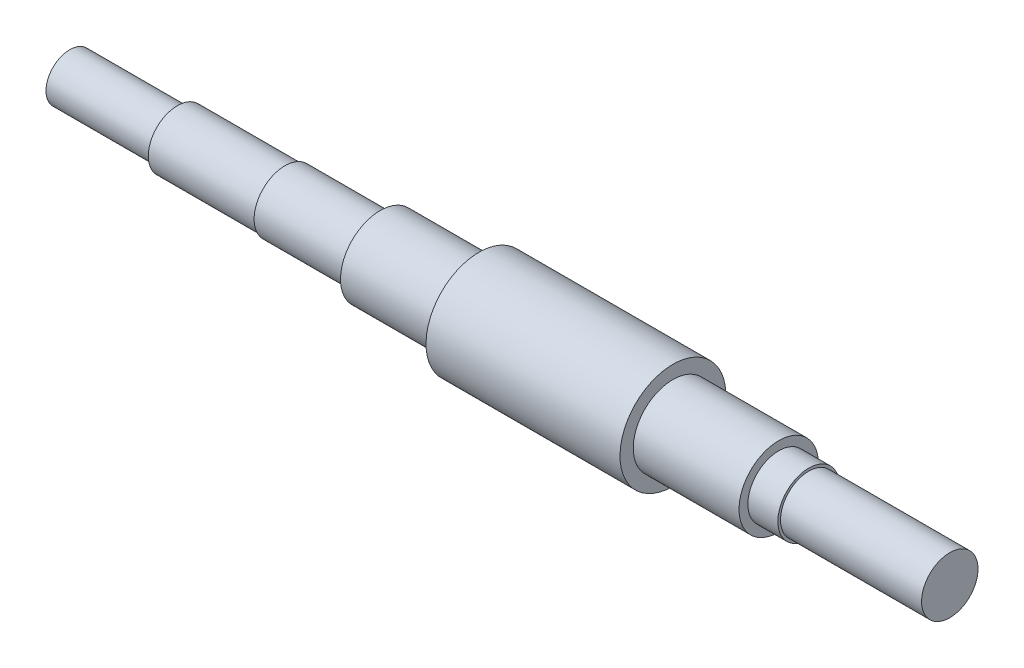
ISO-10303-21;
HEADER;
FILE_DESCRIPTION(('STEP AP214'),'2;1');
FILE_NAME('part.step','',(''),(''),'','','');
FILE_SCHEMA(('AUTOMOTIVE_DESIGN { 1 0 10303 214 1 1 1 1 }'));
ENDSEC;
DATA;
#1=APPLICATION_CONTEXT('core data for automotive mechanical design processes');
#2=APPLICATION_PROTOCOL_DEFINITION('international standard','automotive_design',2000,#1);
#3=PRODUCT_CONTEXT('',#1,'mechanical');
#4=PRODUCT('Part','Part','',(#3));
#5=PRODUCT_RELATED_PRODUCT_CATEGORY('part','',(#4));
#6=PRODUCT_DEFINITION_FORMATION('','',#4);
#7=PRODUCT_DEFINITION_CONTEXT('part definition',#1,'design');
#8=PRODUCT_DEFINITION('design','',#6,#7);
#9=PRODUCT_DEFINITION_SHAPE('','',#8);
#10=(LENGTH_UNIT() NAMED_UNIT(*) SI_UNIT(.MILLI.,.METRE.));
#11=(NAMED_UNIT(*) PLANE_ANGLE_UNIT() SI_UNIT($,.RADIAN.));
#12=(NAMED_UNIT(*) SI_UNIT($,.STERADIAN.) SOLID_ANGLE_UNIT());
#13=UNCERTAINTY_MEASURE_WITH_UNIT(LENGTH_MEASURE(1.E-05),#10,'distance_accuracy_value','');
#14=(GEOMETRIC_REPRESENTATION_CONTEXT(3) GLOBAL_UNCERTAINTY_ASSIGNED_CONTEXT((#13)) GLOBAL_UNIT_ASSIGNED_CONTEXT((#10,
#11,#12)) REPRESENTATION_CONTEXT('',''));
#15=CARTESIAN_POINT('',(0.,0.,0.));
#16=DIRECTION('',(0.,0.,1.));
#17=DIRECTION('',(1.,0.,0.));
#18=AXIS2_PLACEMENT_3D('',#15,#16,#17);
#19=CARTESIAN_POINT('',(0.,0.,0.));
#20=DIRECTION('',(-1.,0.,0.));
#21=DIRECTION('',(0.,-1.,0.));
#22=AXIS2_PLACEMENT_3D('',#19,#20,#21);
#23=PLANE('',#22);
#24=CARTESIAN_POINT('',(0.,0.,0.));
#25=DIRECTION('',(-1.,0.,0.));
#26=DIRECTION('',(0.,-1.,0.));
#27=AXIS2_PLACEMENT_3D('',#24,#25,#26);
#28=CIRCLE('',#27,13.5);
#29=CARTESIAN_POINT('',(0.,-13.5,0.));
#30=VERTEX_POINT('',#29);
#31=EDGE_CURVE('E18',#30,#30,#28,.F.);
#32=ORIENTED_EDGE('',*,*,#31,.F.);
#33=EDGE_LOOP('',(#32));
#34=FACE_BOUND('',#33,.T.);
#35=ADVANCED_FACE('F15',(#34),#23,.T.);
#36=CARTESIAN_POINT('',(523.95,0.,0.));
#37=DIRECTION('',(-1.,0.,0.));
#38=DIRECTION('',(0.,-1.,0.));
#39=AXIS2_PLACEMENT_3D('',#36,#37,#38);
#40=CYLINDRICAL_SURFACE('',#39,13.5);
#41=ORIENTED_EDGE('',*,*,#31,.T.);
#42=EDGE_LOOP('',(#41));
#43=FACE_BOUND('',#42,.T.);
#44=CARTESIAN_POINT('',(61.,0.,0.));
#45=DIRECTION('',(-1.,0.,0.));
#46=DIRECTION('',(0.,-1.,0.));
#47=AXIS2_PLACEMENT_3D('',#44,#45,#46);
#48=CIRCLE('',#47,13.5);
#49=CARTESIAN_POINT('',(61.,-13.5,0.));
#50=VERTEX_POINT('',#49);
#51=EDGE_CURVE('E64',#50,#50,#48,.F.);
#52=ORIENTED_EDGE('',*,*,#51,.F.);
#53=EDGE_LOOP('',(#52));
#54=FACE_BOUND('',#53,.T.);
#55=ADVANCED_FACE('F71',(#43,#54),#40,.T.);
#56=CARTESIAN_POINT('',(499.,0.,0.));
#57=DIRECTION('',(-1.,0.,0.));
#58=DIRECTION('',(0.,-1.,0.));
#59=AXIS2_PLACEMENT_3D('',#56,#57,#58);
#60=PLANE('',#59);
#61=CARTESIAN_POINT('',(499.,0.,0.));
#62=DIRECTION('',(-1.,0.,0.));
#63=DIRECTION('',(0.,-1.,0.));
#64=AXIS2_PLACEMENT_3D('',#61,#62,#63);
#65=CIRCLE('',#64,16.0000000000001);
#66=CARTESIAN_POINT('',(499.,-16.0000000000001,0.));
#67=VERTEX_POINT('',#66);
#68=EDGE_CURVE('E62',#67,#67,#65,.T.);
#69=ORIENTED_EDGE('',*,*,#68,.F.);
#70=EDGE_LOOP('',(#69));
#71=FACE_BOUND('',#70,.T.);
#72=ADVANCED_FACE('F79',(#71),#60,.F.);
#73=CARTESIAN_POINT('',(61.,0.,0.));
#74=DIRECTION('',(-1.,0.,0.));
#75=DIRECTION('',(0.,-1.,0.));
#76=AXIS2_PLACEMENT_3D('',#73,#74,#75);
#77=PLANE('',#76);
#78=ORIENTED_EDGE('',*,*,#51,.T.);
#79=EDGE_LOOP('',(#78));
#80=FACE_BOUND('',#79,.T.);
#81=CARTESIAN_POINT('',(61.,0.,0.));
#82=DIRECTION('',(-1.,0.,0.));
#83=DIRECTION('',(0.,-1.,0.));
#84=AXIS2_PLACEMENT_3D('',#81,#82,#83);
#85=CIRCLE('',#84,16.5);
#86=CARTESIAN_POINT('',(61.,-16.5,0.));
#87=VERTEX_POINT('',#86);
#88=EDGE_CURVE('E59',#87,#87,#85,.F.);
#89=ORIENTED_EDGE('',*,*,#88,.F.);
#90=EDGE_LOOP('',(#89));
#91=FACE_BOUND('',#90,.T.);
#92=ADVANCED_FACE('F134',(#80,#91),#77,.T.);
#93=CARTESIAN_POINT('',(523.95,0.,0.));
#94=DIRECTION('',(-1.,0.,0.));
#95=DIRECTION('',(0.,-1.,0.));
#96=AXIS2_PLACEMENT_3D('',#93,#94,#95);
#97=CYLINDRICAL_SURFACE('',#96,16.0000000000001);
#98=CARTESIAN_POINT('',(419.,0.,0.));
#99=DIRECTION('',(-1.,0.,0.));
#100=DIRECTION('',(0.,-1.,0.));
#101=AXIS2_PLACEMENT_3D('',#98,#99,#100);
#102=CIRCLE('',#101,16.0000000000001);
#103=CARTESIAN_POINT('',(419.,-16.0000000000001,0.));
#104=VERTEX_POINT('',#103);
#105=EDGE_CURVE('E56',#104,#104,#102,.F.);
#106=ORIENTED_EDGE('',*,*,#105,.T.);
#107=EDGE_LOOP('',(#106));
#108=FACE_BOUND('',#107,.T.);
#109=ORIENTED_EDGE('',*,*,#68,.T.);
#110=EDGE_LOOP('',(#109));
#111=FACE_BOUND('',#110,.T.);
#112=ADVANCED_FACE('F130',(#108,#111),#97,.T.);
#113=CARTESIAN_POINT('',(523.95,0.,0.));
#114=DIRECTION('',(-1.,0.,0.));
#115=DIRECTION('',(0.,-1.,0.));
#116=AXIS2_PLACEMENT_3D('',#113,#114,#115);
#117=CYLINDRICAL_SURFACE('',#116,16.5);
#118=ORIENTED_EDGE('',*,*,#88,.T.);
#119=EDGE_LOOP('',(#118));
#120=FACE_BOUND('',#119,.T.);
#121=CARTESIAN_POINT('',(122.,0.,0.));
#122=DIRECTION('',(-1.,0.,0.));
#123=DIRECTION('',(0.,-1.,0.));
#124=AXIS2_PLACEMENT_3D('',#121,#122,#123);
#125=CIRCLE('',#124,16.5);
#126=CARTESIAN_POINT('',(122.,-16.5,0.));
#127=VERTEX_POINT('',#126);
#128=EDGE_CURVE('E53',#127,#127,#125,.F.);
#129=ORIENTED_EDGE('',*,*,#128,.F.);
#130=EDGE_LOOP('',(#129));
#131=FACE_BOUND('',#130,.T.);
#132=ADVANCED_FACE('F126',(#120,#131),#117,.T.);
#133=CARTESIAN_POINT('',(419.,0.,0.));
#134=DIRECTION('',(-1.,0.,0.));
#135=DIRECTION('',(0.,-1.,0.));
#136=AXIS2_PLACEMENT_3D('',#133,#134,#135);
#137=PLANE('',#136);
#138=ORIENTED_EDGE('',*,*,#105,.F.);
#139=EDGE_LOOP('',(#138));
#140=FACE_BOUND('',#139,.T.);
#141=CARTESIAN_POINT('',(419.,0.,0.));
#142=DIRECTION('',(-1.,0.,0.));
#143=DIRECTION('',(0.,-1.,0.));
#144=AXIS2_PLACEMENT_3D('',#141,#142,#143);
#145=CIRCLE('',#144,17.5);
#146=CARTESIAN_POINT('',(419.,-17.5000000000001,0.));
#147=VERTEX_POINT('',#146);
#148=EDGE_CURVE('E50',#147,#147,#145,.T.);
#149=ORIENTED_EDGE('',*,*,#148,.F.);
#150=EDGE_LOOP('',(#149));
#151=FACE_BOUND('',#150,.T.);
#152=ADVANCED_FACE('F122',(#140,#151),#137,.F.);
#153=CARTESIAN_POINT('',(122.,0.,0.));
#154=DIRECTION('',(-1.,0.,0.));
#155=DIRECTION('',(0.,-1.,0.));
#156=AXIS2_PLACEMENT_3D('',#153,#154,#155);
#157=PLANE('',#156);
#158=ORIENTED_EDGE('',*,*,#128,.T.);
#159=EDGE_LOOP('',(#158));
#160=FACE_BOUND('',#159,.T.);
#161=CARTESIAN_POINT('',(122.,0.,0.));
#162=DIRECTION('',(-1.,0.,0.));
#163=DIRECTION('',(0.,-1.,0.));
#164=AXIS2_PLACEMENT_3D('',#161,#162,#163);
#165=CIRCLE('',#164,17.5);
#166=CARTESIAN_POINT('',(122.,-17.5,0.));
#167=VERTEX_POINT('',#166);
#168=EDGE_CURVE('E47',#167,#167,#165,.F.);
#169=ORIENTED_EDGE('',*,*,#168,.F.);
#170=EDGE_LOOP('',(#169));
#171=FACE_BOUND('',#170,.T.);
#172=ADVANCED_FACE('F118',(#160,#171),#157,.T.);
#173=CARTESIAN_POINT('',(523.95,0.,0.));
#174=DIRECTION('',(-1.,0.,0.));
#175=DIRECTION('',(0.,-1.,0.));
#176=AXIS2_PLACEMENT_3D('',#173,#174,#175);
#177=CYLINDRICAL_SURFACE('',#176,17.5);
#178=CARTESIAN_POINT('',(402.,0.,0.));
#179=DIRECTION('',(-1.,0.,0.));
#180=DIRECTION('',(0.,-1.,0.));
#181=AXIS2_PLACEMENT_3D('',#178,#179,#180);
#182=CIRCLE('',#181,17.5);
#183=CARTESIAN_POINT('',(402.,-17.5,0.));
#184=VERTEX_POINT('',#183);
#185=EDGE_CURVE('E44',#184,#184,#182,.F.);
#186=ORIENTED_EDGE('',*,*,#185,.T.);
#187=EDGE_LOOP('',(#186));
#188=FACE_BOUND('',#187,.T.);
#189=ORIENTED_EDGE('',*,*,#148,.T.);
#190=EDGE_LOOP('',(#189));
#191=FACE_BOUND('',#190,.T.);
#192=ADVANCED_FACE('F114',(#188,#191),#177,.T.);
#193=CARTESIAN_POINT('',(523.95,0.,0.));
#194=DIRECTION('',(-1.,0.,0.));
#195=DIRECTION('',(0.,-1.,0.));
#196=AXIS2_PLACEMENT_3D('',#193,#194,#195);
#197=CYLINDRICAL_SURFACE('',#196,17.5);
#198=ORIENTED_EDGE('',*,*,#168,.T.);
#199=EDGE_LOOP('',(#198));
#200=FACE_BOUND('',#199,.T.);
#201=CARTESIAN_POINT('',(176.,0.,0.));
#202=DIRECTION('',(-1.,0.,0.));
#203=DIRECTION('',(0.,-1.,0.));
#204=AXIS2_PLACEMENT_3D('',#201,#202,#203);
#205=CIRCLE('',#204,17.5);
#206=CARTESIAN_POINT('',(176.,-17.5,0.));
#207=VERTEX_POINT('',#206);
#208=EDGE_CURVE('E41',#207,#207,#205,.F.);
#209=ORIENTED_EDGE('',*,*,#208,.F.);
#210=EDGE_LOOP('',(#209));
#211=FACE_BOUND('',#210,.T.);
#212=ADVANCED_FACE('F110',(#200,#211),#197,.T.);
#213=CARTESIAN_POINT('',(402.,0.,0.));
#214=DIRECTION('',(-1.,0.,0.));
#215=DIRECTION('',(0.,-1.,0.));
#216=AXIS2_PLACEMENT_3D('',#213,#214,#215);
#217=PLANE('',#216);
#218=ORIENTED_EDGE('',*,*,#185,.F.);
#219=EDGE_LOOP('',(#218));
#220=FACE_BOUND('',#219,.T.);
#221=CARTESIAN_POINT('',(402.,0.,0.));
#222=DIRECTION('',(-1.,0.,0.));
#223=DIRECTION('',(0.,-1.,0.));
#224=AXIS2_PLACEMENT_3D('',#221,#222,#223);
#225=CIRCLE('',#224,22.5);
#226=CARTESIAN_POINT('',(402.,-22.5,0.));
#227=VERTEX_POINT('',#226);
#228=EDGE_CURVE('E38',#227,#227,#225,.T.);
#229=ORIENTED_EDGE('',*,*,#228,.F.);
#230=EDGE_LOOP('',(#229));
#231=FACE_BOUND('',#230,.T.);
#232=ADVANCED_FACE('F106',(#220,#231),#217,.F.);
#233=CARTESIAN_POINT('',(176.,0.,0.));
#234=DIRECTION('',(-1.,0.,0.));
#235=DIRECTION('',(0.,-1.,0.));
#236=AXIS2_PLACEMENT_3D('',#233,#234,#235);
#237=PLANE('',#236);
#238=ORIENTED_EDGE('',*,*,#208,.T.);
#239=EDGE_LOOP('',(#238));
#240=FACE_BOUND('',#239,.T.);
#241=CARTESIAN_POINT('',(176.,0.,0.));
#242=DIRECTION('',(-1.,0.,0.));
#243=DIRECTION('',(0.,-1.,0.));
#244=AXIS2_PLACEMENT_3D('',#241,#242,#243);
#245=CIRCLE('',#244,22.5);
#246=CARTESIAN_POINT('',(176.,-22.5,0.));
#247=VERTEX_POINT('',#246);
#248=EDGE_CURVE('E35',#247,#247,#245,.F.);
#249=ORIENTED_EDGE('',*,*,#248,.F.);
#250=EDGE_LOOP('',(#249));
#251=FACE_BOUND('',#250,.T.);
#252=ADVANCED_FACE('F102',(#240,#251),#237,.T.);
#253=CARTESIAN_POINT('',(523.95,0.,0.));
#254=DIRECTION('',(-1.,0.,0.));
#255=DIRECTION('',(0.,-1.,0.));
#256=AXIS2_PLACEMENT_3D('',#253,#254,#255);
#257=CYLINDRICAL_SURFACE('',#256,22.5);
#258=CARTESIAN_POINT('',(342.,0.,0.));
#259=DIRECTION('',(-1.,0.,0.));
#260=DIRECTION('',(0.,-1.,0.));
#261=AXIS2_PLACEMENT_3D('',#258,#259,#260);
#262=CIRCLE('',#261,22.5);
#263=CARTESIAN_POINT('',(342.,-22.5,0.));
#264=VERTEX_POINT('',#263);
#265=EDGE_CURVE('E32',#264,#264,#262,.F.);
#266=ORIENTED_EDGE('',*,*,#265,.T.);
#267=EDGE_LOOP('',(#266));
#268=FACE_BOUND('',#267,.T.);
#269=ORIENTED_EDGE('',*,*,#228,.T.);
#270=EDGE_LOOP('',(#269));
#271=FACE_BOUND('',#270,.T.);
#272=ADVANCED_FACE('F98',(#268,#271),#257,.T.);
#273=CARTESIAN_POINT('',(523.95,0.,0.));
#274=DIRECTION('',(-1.,0.,0.));
#275=DIRECTION('',(0.,-1.,0.));
#276=AXIS2_PLACEMENT_3D('',#273,#274,#275);
#277=CYLINDRICAL_SURFACE('',#276,22.5);
#278=ORIENTED_EDGE('',*,*,#248,.T.);
#279=EDGE_LOOP('',(#278));
#280=FACE_BOUND('',#279,.T.);
#281=CARTESIAN_POINT('',(232.,0.,0.));
#282=DIRECTION('',(-1.,0.,0.));
#283=DIRECTION('',(0.,-1.,0.));
#284=AXIS2_PLACEMENT_3D('',#281,#282,#283);
#285=CIRCLE('',#284,22.5);
#286=CARTESIAN_POINT('',(232.,-22.5,0.));
#287=VERTEX_POINT('',#286);
#288=EDGE_CURVE('E27',#287,#287,#285,.F.);
#289=ORIENTED_EDGE('',*,*,#288,.F.);
#290=EDGE_LOOP('',(#289));
#291=FACE_BOUND('',#290,.T.);
#292=ADVANCED_FACE('F94',(#280,#291),#277,.T.);
#293=CARTESIAN_POINT('',(342.,0.,0.));
#294=DIRECTION('',(-1.,0.,0.));
#295=DIRECTION('',(0.,-1.,0.));
#296=AXIS2_PLACEMENT_3D('',#293,#294,#295);
#297=PLANE('',#296);
#298=ORIENTED_EDGE('',*,*,#265,.F.);
#299=EDGE_LOOP('',(#298));
#300=FACE_BOUND('',#299,.T.);
#301=CARTESIAN_POINT('',(342.,0.,0.));
#302=DIRECTION('',(-1.,0.,0.));
#303=DIRECTION('',(0.,-1.,0.));
#304=AXIS2_PLACEMENT_3D('',#301,#302,#303);
#305=CIRCLE('',#304,30.);
#306=CARTESIAN_POINT('',(342.,-30.,0.));
#307=VERTEX_POINT('',#306);
#308=EDGE_CURVE('E22',#307,#307,#305,.T.);
#309=ORIENTED_EDGE('',*,*,#308,.F.);
#310=EDGE_LOOP('',(#309));
#311=FACE_BOUND('',#310,.T.);
#312=ADVANCED_FACE('F87',(#300,#311),#297,.F.);
#313=CARTESIAN_POINT('',(232.,0.,0.));
#314=DIRECTION('',(-1.,0.,0.));
#315=DIRECTION('',(0.,-1.,0.));
#316=AXIS2_PLACEMENT_3D('',#313,#314,#315);
#317=PLANE('',#316);
#318=ORIENTED_EDGE('',*,*,#288,.T.);
#319=EDGE_LOOP('',(#318));
#320=FACE_BOUND('',#319,.T.);
#321=CARTESIAN_POINT('',(232.,0.,0.));
#322=DIRECTION('',(-1.,0.,0.));
#323=DIRECTION('',(0.,-1.,0.));
#324=AXIS2_PLACEMENT_3D('',#321,#322,#323);
#325=CIRCLE('',#324,30.);
#326=CARTESIAN_POINT('',(232.,-30.,0.));
#327=VERTEX_POINT('',#326);
#328=EDGE_CURVE('E10',#327,#327,#325,.F.);
#329=ORIENTED_EDGE('',*,*,#328,.F.);
#330=EDGE_LOOP('',(#329));
#331=FACE_BOUND('',#330,.T.);
#332=ADVANCED_FACE('F82',(#320,#331),#317,.T.);
#333=CARTESIAN_POINT('',(523.95,0.,0.));
#334=DIRECTION('',(-1.,0.,0.));
#335=DIRECTION('',(0.,-1.,0.));
#336=AXIS2_PLACEMENT_3D('',#333,#334,#335);
#337=CYLINDRICAL_SURFACE('',#336,30.);
#338=ORIENTED_EDGE('',*,*,#328,.T.);
#339=EDGE_LOOP('',(#338));
#340=FACE_BOUND('',#339,.T.);
#341=ORIENTED_EDGE('',*,*,#308,.T.);
#342=EDGE_LOOP('',(#341));
#343=FACE_BOUND('',#342,.T.);
#344=ADVANCED_FACE('F80',(#340,#343),#337,.T.);
#345=CLOSED_SHELL('',(#35,#55,#72,#92,#112,#132,#152,#172,#192,#212,#232,#252,#272,#292,#312,
#332,#344));
#346=MANIFOLD_SOLID_BREP('B1',#345);
#347=ADVANCED_BREP_SHAPE_REPRESENTATION('',(#18,#346),#14);
#348=SHAPE_DEFINITION_REPRESENTATION(#9,#347);
ENDSEC;
END-ISO-10303-21;
